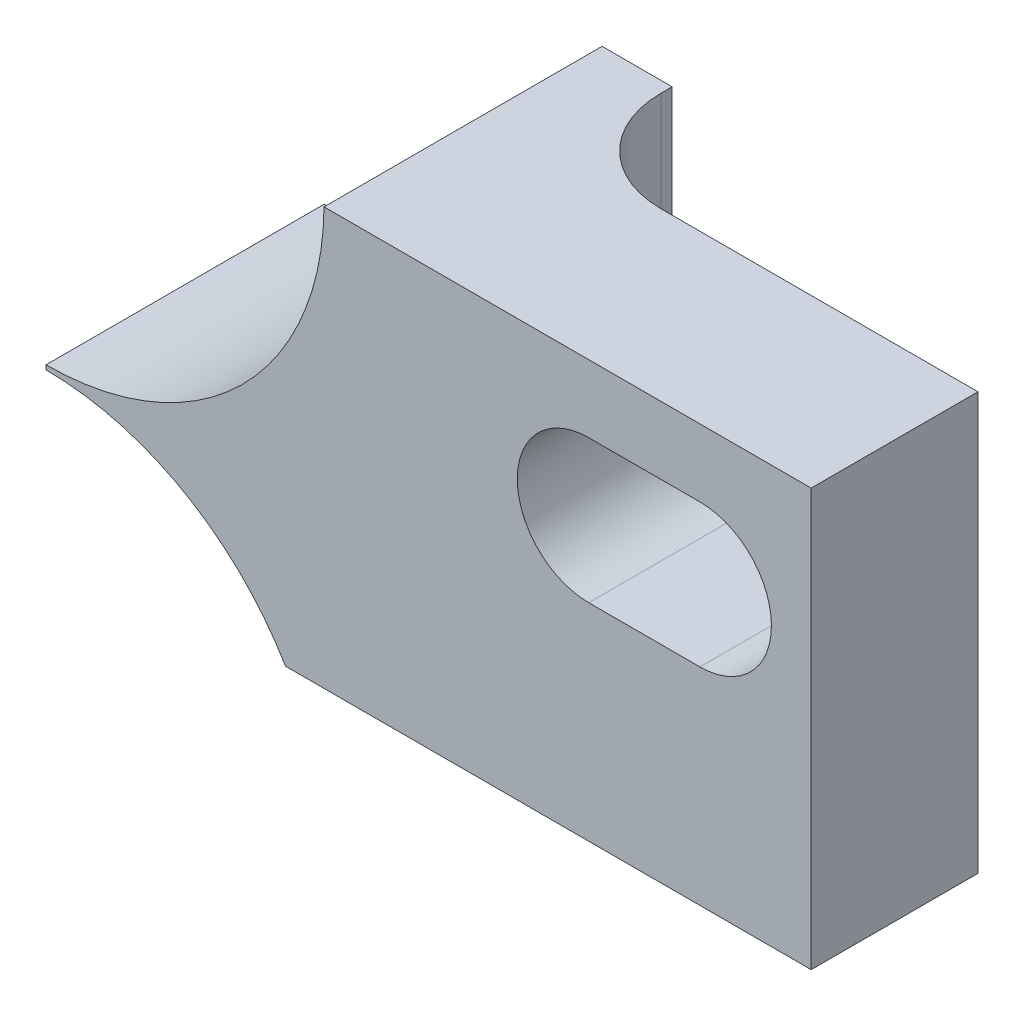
from build123d import *

# Parameters (mm, degrees)
SKETCH1_R          = 1.63195
EXTRUDE1_DEPTH     = 6.35
SKETCH2_W          = 6.35
SKETCH2_H          = 2.54
CUT_EXTRUDE1_DEPTH = 116.178567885
CUT_EXTRUDE2_DEPTH = 115.871833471
CUT_EXTRUDE3_DEPTH = 115.871833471
SKETCH5_R          = 1.63195
CUT_EXTRUDE4_DEPTH = 116.178567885
SKETCH7_W          = 101.6
SKETCH7_H          = 25.4
EXTRUDE10_DEPTH    = 116.178567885


with BuildPart() as part:
    # Sketch1 → Extrude1 (new body)
    with BuildSketch(Plane.XY):
        with BuildLine():
            Line((0, 9.525), (0, 0))
            Line((0, 0), (7.950403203, 0))
            ThreePointArc((7.950403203, 0), (12.65282779, 6.081790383), (19.769817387, 3.175))
            Line((19.769817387, 3.175), (91.355182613, 3.175))
            ThreePointArc((91.355182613, 3.175), (96.8248, 6.2992), (102.294417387, 3.175))
            Line((102.294417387, 3.175), (114.3, 3.175))
            Line((114.3, 3.175), (114.3, 12.7))
            Line((114.3, 12.7), (103.174596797, 12.7))
            ThreePointArc((103.174596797, 12.7), (98.47217221, 6.618209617), (91.355182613, 9.525))
            Line((91.355182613, 9.525), (19.769817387, 9.525))
            ThreePointArc((19.769817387, 9.525), (14.3002, 6.4008), (8.830582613, 9.525))
            Line((8.830582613, 9.525), (0, 9.525))
        make_face()
        with BuildLine():
            Line((109.22, 11.15695), (111.76, 11.15695))
            ThreePointArc((111.76, 11.15695), (113.39195, 9.525), (111.76, 7.89305))
            Line((111.76, 7.89305), (109.22, 7.89305))
            ThreePointArc((109.22, 7.89305), (107.58805, 9.525), (109.22, 11.15695))
        make_face(mode=Mode.SUBTRACT)
        with Locations(Location((3.175, 3.175, 0), (0, 0, 180))):
            Circle(SKETCH1_R, mode=Mode.SUBTRACT)
    extrude(amount=EXTRUDE1_DEPTH)

    # Sketch2 → Cut-Extrude1 (cut, through all)
    with BuildSketch(Plane.XZ):
        with Locations((3.175, 1.27)):
            Rectangle(SKETCH2_W, SKETCH2_H)
    extrude(amount=-CUT_EXTRUDE1_DEPTH, mode=Mode.SUBTRACT)

    # Sketch3 → Cut-Extrude2 (cut, through all)
    with BuildSketch(Plane.XZ.offset(-3.175)):
        with BuildLine():
            Line((104.775, 0), (114.3, 0))
            Line((114.3, 0), (114.3, 2.54))
            Line((114.3, 2.54), (107.061, 2.54))
            ThreePointArc((107.061, 2.54), (105.444553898, 1.870446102), (104.775, 0.254))
            Line((104.775, 0.254), (104.775, 0))
        make_face()
    extrude(amount=-CUT_EXTRUDE2_DEPTH, mode=Mode.SUBTRACT)

    # Sketch4 → Cut-Extrude3 (cut, through all)
    with BuildSketch(Plane(origin=(0, 9.525, 0), x_dir=(1, 0, 0), z_dir=(0, 1, 0))):
        with BuildLine():
            ThreePointArc((25.4, -2.794), (25.848403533, -1.167255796), (27.066958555, 0))
            Line((27.066958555, 0), (25.4, 0))
            Line((25.4, 0), (25.4, -2.794))
        make_face()
        with BuildLine():
            Line((31.75, -2.794), (31.75, 0))
            Line((31.75, 0), (30.083041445, 0))
            ThreePointArc((30.083041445, 0), (31.301596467, -1.167255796), (31.75, -2.794))
        make_face()
        with BuildLine():
            ThreePointArc((31.75, -2.794), (31.301596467, -1.167255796), (30.083041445, 0))
            Line((30.083041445, 0), (27.066958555, 0))
            ThreePointArc((27.066958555, 0), (25.848403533, -1.167255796), (25.4, -2.794))
            Line((25.4, -2.794), (31.75, -2.794))
        make_face()
        with BuildLine():
            ThreePointArc((25.4, -2.794), (28.575, -5.969), (31.75, -2.794))
            Line((31.75, -2.794), (25.4, -2.794))
        make_face()
        with BuildLine():
            Line((79.375, 0), (79.375, -2.794))
            ThreePointArc((79.375, -2.794), (79.823403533, -1.167255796), (81.041958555, 0))
            Line((81.041958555, 0), (79.375, 0))
        make_face()
        with BuildLine():
            Line((79.375, -2.794), (85.725, -2.794))
            ThreePointArc((85.725, -2.794), (85.276596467, -1.167255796), (84.058041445, 0))
            Line((84.058041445, 0), (81.041958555, 0))
            ThreePointArc((81.041958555, 0), (79.823403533, -1.167255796), (79.375, -2.794))
        make_face()
        with BuildLine():
            ThreePointArc((84.058041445, 0), (85.276596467, -1.167255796), (85.725, -2.794))
            Line((85.725, -2.794), (85.725, 0))
            Line((85.725, 0), (84.058041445, 0))
        make_face()
        with BuildLine():
            ThreePointArc((79.375, -2.794), (82.55, -5.969), (85.725, -2.794))
            Line((85.725, -2.794), (79.375, -2.794))
        make_face()
    extrude(amount=-CUT_EXTRUDE3_DEPTH, mode=Mode.SUBTRACT)

    # Sketch5 → Cut-Extrude4 (cut, through all)
    with BuildSketch(Plane(origin=(0, 0, 0), x_dir=(-1, 0, 0), z_dir=(0, 0, -1))):
        with Locations((-74.93, 6.35)):
            Circle(SKETCH5_R)
        with Locations((-39.37, 6.35)):
            Circle(SKETCH5_R)
    extrude(amount=-CUT_EXTRUDE4_DEPTH, mode=Mode.SUBTRACT)

    # Sketch7 → Extrude10 (cut, through all)
    with BuildSketch(Plane(origin=(0, 0, 0), x_dir=(-1, 0, 0), z_dir=(0, 0, -1))):
        with Locations((-46.0248, 12.6492)):
            Rectangle(SKETCH7_W, SKETCH7_H)
    extrude(amount=-EXTRUDE10_DEPTH, mode=Mode.SUBTRACT)


solid = part.part
